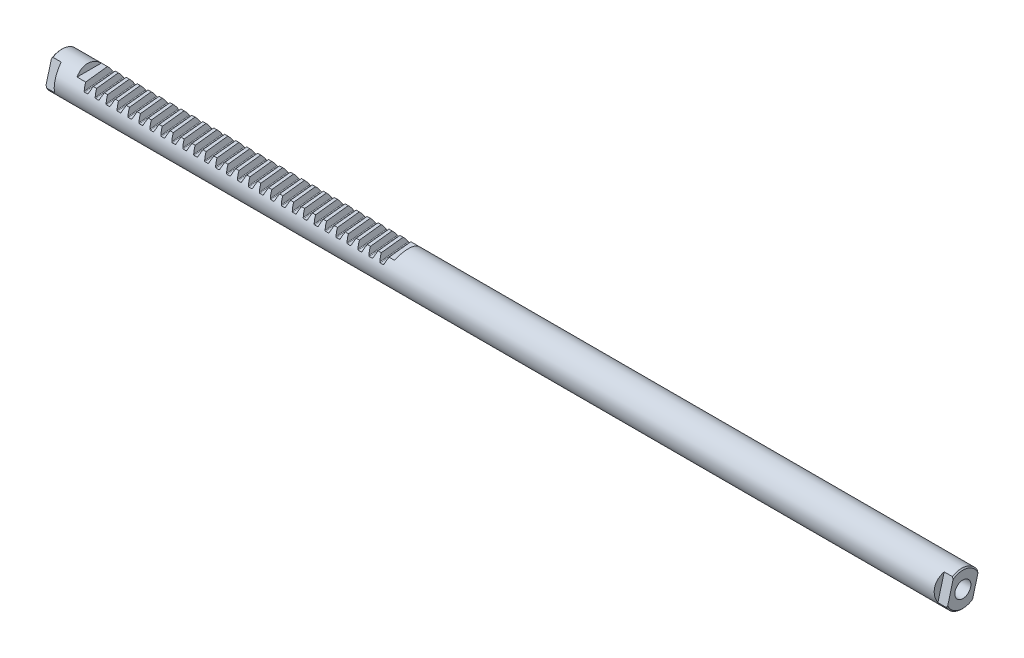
from build123d import *

# Parameters (mm, degrees)
ENL_V_MAT_EXTRU_1_DEPTH    = 12.5
ENL_V_MAT_EXTRU_2_DEPTH    = 12.5
R_P_TITION_LIN_AIRE2_COUNT = 28
R_P_TITION_LIN_AIRE2_PITCH = 6.8
ENL_V_MAT_EXTRU_3_DEPTH    = 12.5


with BuildPart() as part:
    # Esquisse1 → Base-R_volution (revolve)
    with BuildSketch(Plane.XY, mode=Mode.PRIVATE) as base_r_volution_sk:
        Polygon((-257.113248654, 0), (257.113248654, 0), (260, 5), (280, 5), (280, 10.292893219), (279.292893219, 11), (-279.292893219, 11), (-280, 10.292893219), (-280, 5), (-260, 5), align=None)
    revolve(base_r_volution_sk.sketch.rotate(Axis((301, 0, 0), (-1, 0, 0)), 61.658241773), axis=Axis((301, 0, 0), (-1, 0, 0)))

    # Esquisse2 → Enl_v. mat.-Extru.1 (cut, symmetric)
    with BuildSketch(Plane.XY):
        Polygon((-262.544119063, 8), (-65.455880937, 8), (-64, 12), (-264, 12), align=None)
    extrude(amount=ENL_V_MAT_EXTRU_1_DEPTH, both=True, mode=Mode.SUBTRACT)

    # Esquisse4 → Enl_v. mat.-Extru.2 (cut, symmetric)
    with BuildSketch(Plane(origin=(-514.586649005, 0, 26.968343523), x_dir=(-0.9945218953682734, 0, 0.10452846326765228), z_dir=(-0.10452846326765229, 0, -0.9945218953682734))):
        with BuildLine():
            Line((-262.8, 8), (-261.691343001, 4.953989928))
            ThreePointArc((-261.691343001, 4.953989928), (-261.508284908, 4.715423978), (-261.22149669, 4.625))
            Line((-261.22149669, 4.625), (-259.57850331, 4.625))
            ThreePointArc((-259.57850331, 4.625), (-259.291715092, 4.715423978), (-259.108656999, 4.953989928))
            Line((-259.108656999, 4.953989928), (-258, 8))
            Line((-258, 8), (-262.8, 8))
        make_face()
    enl_v_mat_extru_2 = extrude(amount=ENL_V_MAT_EXTRU_2_DEPTH, both=True, mode=Mode.SUBTRACT)

    # R_p_tition lin_aire2: Enl_v. mat.-Extru.2 ×28
    with Locations(*[(i * R_P_TITION_LIN_AIRE2_PITCH, 0, 0) for i in range(1, R_P_TITION_LIN_AIRE2_COUNT)]):
        add(enl_v_mat_extru_2, mode=Mode.SUBTRACT)

    # Esquisse6 → Enl_v. mat.-Extru.3 (cut, symmetric)
    with BuildSketch(Plane(origin=(0, 0, 0), x_dir=(-1, 0, 0), z_dir=(0, 0.9659258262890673, -0.2588190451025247))):
        Polygon((-283, 8), (-274.183821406, 8), (-272, 14), (-283, 14), align=None)
        Polygon((274.183821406, 8), (272, 14), (283, 14), (283, 8), align=None)
        Polygon((-283, -14), (-283, -8), (-274.183821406, -8), (-272, -14), align=None)
        Polygon((274.183821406, -8), (272, -14), (283, -14), (283, -8), align=None)
    extrude(amount=ENL_V_MAT_EXTRU_3_DEPTH, both=True, mode=Mode.SUBTRACT)


solid = part.part
